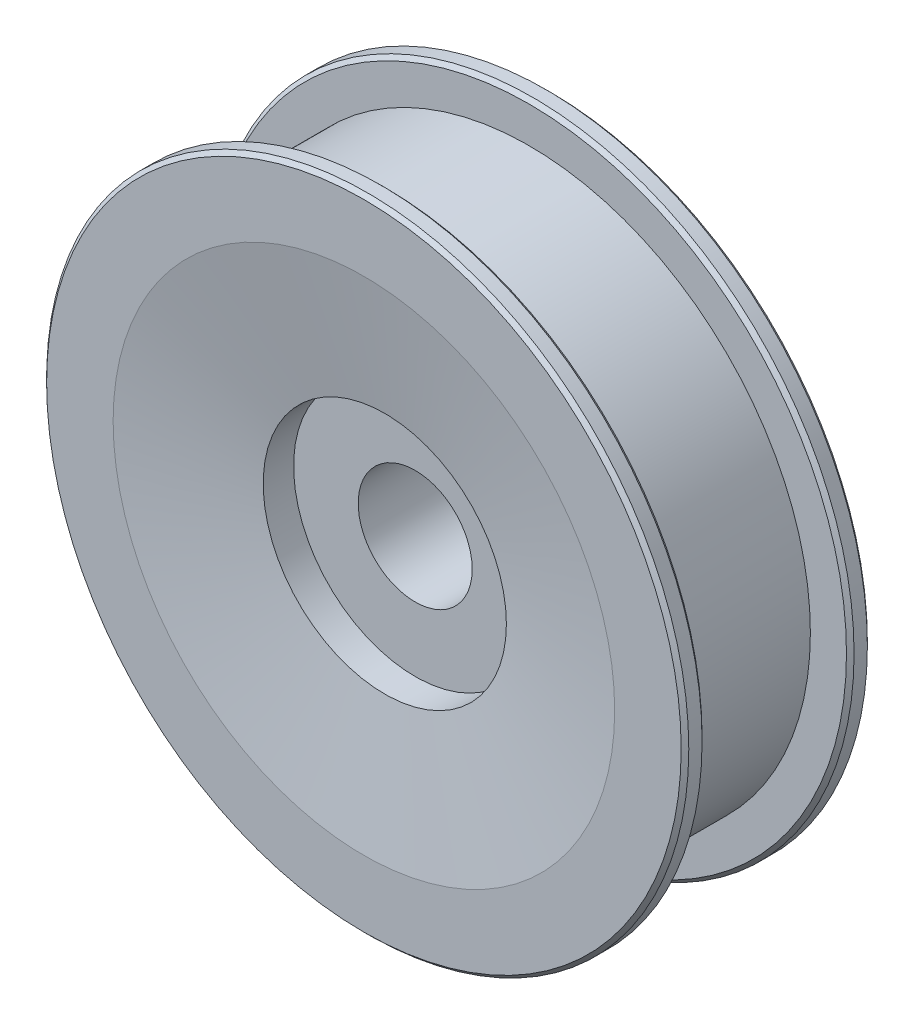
ISO-10303-21;
HEADER;
FILE_DESCRIPTION(('STEP AP214'),'2;1');
FILE_NAME('part.step','',(''),(''),'','','');
FILE_SCHEMA(('AUTOMOTIVE_DESIGN { 1 0 10303 214 1 1 1 1 }'));
ENDSEC;
DATA;
#1=APPLICATION_CONTEXT('core data for automotive mechanical design processes');
#2=APPLICATION_PROTOCOL_DEFINITION('international standard','automotive_design',2000,#1);
#3=PRODUCT_CONTEXT('',#1,'mechanical');
#4=PRODUCT('Part','Part','',(#3));
#5=PRODUCT_RELATED_PRODUCT_CATEGORY('part','',(#4));
#6=PRODUCT_DEFINITION_FORMATION('','',#4);
#7=PRODUCT_DEFINITION_CONTEXT('part definition',#1,'design');
#8=PRODUCT_DEFINITION('design','',#6,#7);
#9=PRODUCT_DEFINITION_SHAPE('','',#8);
#10=(LENGTH_UNIT() NAMED_UNIT(*) SI_UNIT(.MILLI.,.METRE.));
#11=(NAMED_UNIT(*) PLANE_ANGLE_UNIT() SI_UNIT($,.RADIAN.));
#12=(NAMED_UNIT(*) SI_UNIT($,.STERADIAN.) SOLID_ANGLE_UNIT());
#13=UNCERTAINTY_MEASURE_WITH_UNIT(LENGTH_MEASURE(1.E-05),#10,'distance_accuracy_value','');
#14=(GEOMETRIC_REPRESENTATION_CONTEXT(3) GLOBAL_UNCERTAINTY_ASSIGNED_CONTEXT((#13)) GLOBAL_UNIT_ASSIGNED_CONTEXT((#10,
#11,#12)) REPRESENTATION_CONTEXT('',''));
#15=CARTESIAN_POINT('',(0.,0.,0.));
#16=DIRECTION('',(0.,0.,1.));
#17=DIRECTION('',(1.,0.,0.));
#18=AXIS2_PLACEMENT_3D('',#15,#16,#17);
#19=CARTESIAN_POINT('',(0.,-7.5,-5.5));
#20=DIRECTION('',(0.,0.,-1.));
#21=DIRECTION('',(1.,0.,0.));
#22=AXIS2_PLACEMENT_3D('',#19,#20,#21);
#23=PLANE('',#22);
#24=CARTESIAN_POINT('',(0.,0.,-5.5));
#25=DIRECTION('',(0.,0.,-1.));
#26=DIRECTION('',(1.,0.,0.));
#27=AXIS2_PLACEMENT_3D('',#24,#25,#26);
#28=CIRCLE('',#27,16.);
#29=CARTESIAN_POINT('',(16.,0.,-5.5));
#30=VERTEX_POINT('',#29);
#31=EDGE_CURVE('E71',#30,#30,#28,.T.);
#32=ORIENTED_EDGE('',*,*,#31,.T.);
#33=EDGE_LOOP('',(#32));
#34=FACE_BOUND('',#33,.T.);
#35=CARTESIAN_POINT('',(0.,0.,-5.5));
#36=DIRECTION('',(0.,0.,-1.));
#37=DIRECTION('',(1.,0.,0.));
#38=AXIS2_PLACEMENT_3D('',#35,#36,#37);
#39=CIRCLE('',#38,7.5);
#40=CARTESIAN_POINT('',(7.5,0.,-5.5));
#41=VERTEX_POINT('',#40);
#42=EDGE_CURVE('E44',#41,#41,#39,.T.);
#43=ORIENTED_EDGE('',*,*,#42,.F.);
#44=EDGE_LOOP('',(#43));
#45=FACE_BOUND('',#44,.T.);
#46=ADVANCED_FACE('F12',(#34,#45),#23,.T.);
#47=CARTESIAN_POINT('',(0.,0.,-20.));
#48=DIRECTION('',(0.,0.,-1.));
#49=DIRECTION('',(1.,0.,0.));
#50=AXIS2_PLACEMENT_3D('',#47,#48,#49);
#51=CYLINDRICAL_SURFACE('',#50,7.5);
#52=ORIENTED_EDGE('',*,*,#42,.T.);
#53=EDGE_LOOP('',(#52));
#54=FACE_BOUND('',#53,.T.);
#55=CARTESIAN_POINT('',(0.,0.,5.5));
#56=DIRECTION('',(0.,0.,-1.));
#57=DIRECTION('',(1.,0.,0.));
#58=AXIS2_PLACEMENT_3D('',#55,#56,#57);
#59=CIRCLE('',#58,7.5);
#60=CARTESIAN_POINT('',(7.5,0.,5.5));
#61=VERTEX_POINT('',#60);
#62=EDGE_CURVE('E47',#61,#61,#59,.T.);
#63=ORIENTED_EDGE('',*,*,#62,.F.);
#64=EDGE_LOOP('',(#63));
#65=FACE_BOUND('',#64,.T.);
#66=ADVANCED_FACE('F96',(#54,#65),#51,.F.);
#67=CARTESIAN_POINT('',(0.,-7.5,5.5));
#68=DIRECTION('',(0.,0.,-1.));
#69=DIRECTION('',(1.,0.,0.));
#70=AXIS2_PLACEMENT_3D('',#67,#68,#69);
#71=PLANE('',#70);
#72=CARTESIAN_POINT('',(0.,0.,5.5));
#73=DIRECTION('',(0.,0.,-1.));
#74=DIRECTION('',(1.,0.,0.));
#75=AXIS2_PLACEMENT_3D('',#72,#73,#74);
#76=CIRCLE('',#75,16.);
#77=CARTESIAN_POINT('',(16.,0.,5.5));
#78=VERTEX_POINT('',#77);
#79=EDGE_CURVE('E50',#78,#78,#76,.T.);
#80=ORIENTED_EDGE('',*,*,#79,.F.);
#81=EDGE_LOOP('',(#80));
#82=FACE_BOUND('',#81,.T.);
#83=ORIENTED_EDGE('',*,*,#62,.T.);
#84=EDGE_LOOP('',(#83));
#85=FACE_BOUND('',#84,.T.);
#86=ADVANCED_FACE('F102',(#82,#85),#71,.F.);
#87=CARTESIAN_POINT('',(0.,0.,-20.));
#88=DIRECTION('',(0.,0.,-1.));
#89=DIRECTION('',(1.,0.,0.));
#90=AXIS2_PLACEMENT_3D('',#87,#88,#89);
#91=CYLINDRICAL_SURFACE('',#90,16.);
#92=CARTESIAN_POINT('',(0.,0.,9.5));
#93=DIRECTION('',(0.,0.,-1.));
#94=DIRECTION('',(1.,0.,0.));
#95=AXIS2_PLACEMENT_3D('',#92,#93,#94);
#96=CIRCLE('',#95,16.);
#97=CARTESIAN_POINT('',(16.,0.,9.5));
#98=VERTEX_POINT('',#97);
#99=EDGE_CURVE('E53',#98,#98,#96,.T.);
#100=ORIENTED_EDGE('',*,*,#99,.F.);
#101=EDGE_LOOP('',(#100));
#102=FACE_BOUND('',#101,.T.);
#103=ORIENTED_EDGE('',*,*,#79,.T.);
#104=EDGE_LOOP('',(#103));
#105=FACE_BOUND('',#104,.T.);
#106=ADVANCED_FACE('F141',(#102,#105),#91,.F.);
#107=CARTESIAN_POINT('',(0.,0.,9.5));
#108=DIRECTION('',(0.,0.,1.));
#109=DIRECTION('',(-1.,0.,0.));
#110=AXIS2_PLACEMENT_3D('',#107,#108,#109);
#111=CONICAL_SURFACE('',#110,16.,1.41042088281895);
#112=CARTESIAN_POINT('',(0.,0.,12.25));
#113=DIRECTION('',(0.,0.,-1.));
#114=DIRECTION('',(1.,0.,0.));
#115=AXIS2_PLACEMENT_3D('',#112,#113,#114);
#116=CIRCLE('',#115,33.);
#117=CARTESIAN_POINT('',(33.,0.,12.25));
#118=VERTEX_POINT('',#117);
#119=EDGE_CURVE('E56',#118,#118,#116,.T.);
#120=ORIENTED_EDGE('',*,*,#119,.F.);
#121=EDGE_LOOP('',(#120));
#122=FACE_BOUND('',#121,.T.);
#123=ORIENTED_EDGE('',*,*,#99,.T.);
#124=EDGE_LOOP('',(#123));
#125=FACE_BOUND('',#124,.T.);
#126=ADVANCED_FACE('F135',(#122,#125),#111,.F.);
#127=CARTESIAN_POINT('',(0.,-42.25,12.25));
#128=DIRECTION('',(0.,0.,1.));
#129=DIRECTION('',(-1.,0.,0.));
#130=AXIS2_PLACEMENT_3D('',#127,#128,#129);
#131=PLANE('',#130);
#132=CARTESIAN_POINT('',(0.,0.,12.25));
#133=DIRECTION('',(0.,0.,1.));
#134=DIRECTION('',(1.,0.,0.));
#135=AXIS2_PLACEMENT_3D('',#132,#133,#134);
#136=CIRCLE('',#135,41.75);
#137=CARTESIAN_POINT('',(41.75,0.,12.25));
#138=VERTEX_POINT('',#137);
#139=EDGE_CURVE('E19',#138,#138,#136,.T.);
#140=ORIENTED_EDGE('',*,*,#139,.T.);
#141=EDGE_LOOP('',(#140));
#142=FACE_BOUND('',#141,.T.);
#143=ORIENTED_EDGE('',*,*,#119,.T.);
#144=EDGE_LOOP('',(#143));
#145=FACE_BOUND('',#144,.T.);
#146=ADVANCED_FACE('F124',(#142,#145),#131,.T.);
#147=CARTESIAN_POINT('',(0.,0.,-20.));
#148=DIRECTION('',(0.,0.,-1.));
#149=DIRECTION('',(1.,0.,0.));
#150=AXIS2_PLACEMENT_3D('',#147,#148,#149);
#151=CYLINDRICAL_SURFACE('',#150,42.25);
#152=CARTESIAN_POINT('',(0.,0.,11.75));
#153=DIRECTION('',(0.,0.,1.));
#154=DIRECTION('',(1.,0.,0.));
#155=AXIS2_PLACEMENT_3D('',#152,#153,#154);
#156=CIRCLE('',#155,42.25);
#157=CARTESIAN_POINT('',(42.25,0.,11.75));
#158=VERTEX_POINT('',#157);
#159=EDGE_CURVE('E23',#158,#158,#156,.F.);
#160=ORIENTED_EDGE('',*,*,#159,.T.);
#161=EDGE_LOOP('',(#160));
#162=FACE_BOUND('',#161,.T.);
#163=CARTESIAN_POINT('',(0.,0.,10.));
#164=DIRECTION('',(0.,0.,1.));
#165=DIRECTION('',(1.,0.,0.));
#166=AXIS2_PLACEMENT_3D('',#163,#164,#165);
#167=CIRCLE('',#166,42.25);
#168=CARTESIAN_POINT('',(42.25,0.,10.));
#169=VERTEX_POINT('',#168);
#170=EDGE_CURVE('E27',#169,#169,#167,.T.);
#171=ORIENTED_EDGE('',*,*,#170,.T.);
#172=EDGE_LOOP('',(#171));
#173=FACE_BOUND('',#172,.T.);
#174=ADVANCED_FACE('F120',(#162,#173),#151,.T.);
#175=CARTESIAN_POINT('',(0.,-42.25,9.5));
#176=DIRECTION('',(0.,0.,1.));
#177=DIRECTION('',(-1.,0.,0.));
#178=AXIS2_PLACEMENT_3D('',#175,#176,#177);
#179=PLANE('',#178);
#180=CARTESIAN_POINT('',(0.,0.,9.5));
#181=DIRECTION('',(0.,0.,1.));
#182=DIRECTION('',(1.,0.,0.));
#183=AXIS2_PLACEMENT_3D('',#180,#181,#182);
#184=CIRCLE('',#183,41.75);
#185=CARTESIAN_POINT('',(41.75,0.,9.5));
#186=VERTEX_POINT('',#185);
#187=EDGE_CURVE('E8',#186,#186,#184,.F.);
#188=ORIENTED_EDGE('',*,*,#187,.T.);
#189=EDGE_LOOP('',(#188));
#190=FACE_BOUND('',#189,.T.);
#191=CARTESIAN_POINT('',(0.,0.,9.5));
#192=DIRECTION('',(0.,0.,-1.));
#193=DIRECTION('',(1.,0.,0.));
#194=AXIS2_PLACEMENT_3D('',#191,#192,#193);
#195=CIRCLE('',#194,37.);
#196=CARTESIAN_POINT('',(37.,0.,9.5));
#197=VERTEX_POINT('',#196);
#198=EDGE_CURVE('E59',#197,#197,#195,.T.);
#199=ORIENTED_EDGE('',*,*,#198,.F.);
#200=EDGE_LOOP('',(#199));
#201=FACE_BOUND('',#200,.T.);
#202=ADVANCED_FACE('F123',(#190,#201),#179,.F.);
#203=CARTESIAN_POINT('',(0.,0.,-20.));
#204=DIRECTION('',(0.,0.,-1.));
#205=DIRECTION('',(1.,0.,0.));
#206=AXIS2_PLACEMENT_3D('',#203,#204,#205);
#207=CYLINDRICAL_SURFACE('',#206,37.);
#208=ORIENTED_EDGE('',*,*,#198,.T.);
#209=EDGE_LOOP('',(#208));
#210=FACE_BOUND('',#209,.T.);
#211=CARTESIAN_POINT('',(0.,0.,-9.5));
#212=DIRECTION('',(0.,0.,-1.));
#213=DIRECTION('',(1.,0.,0.));
#214=AXIS2_PLACEMENT_3D('',#211,#212,#213);
#215=CIRCLE('',#214,37.);
#216=CARTESIAN_POINT('',(37.,0.,-9.5));
#217=VERTEX_POINT('',#216);
#218=EDGE_CURVE('E62',#217,#217,#215,.T.);
#219=ORIENTED_EDGE('',*,*,#218,.F.);
#220=EDGE_LOOP('',(#219));
#221=FACE_BOUND('',#220,.T.);
#222=ADVANCED_FACE('F133',(#210,#221),#207,.T.);
#223=CARTESIAN_POINT('',(0.,-42.25,-9.5));
#224=DIRECTION('',(0.,0.,1.));
#225=DIRECTION('',(-1.,0.,0.));
#226=AXIS2_PLACEMENT_3D('',#223,#224,#225);
#227=PLANE('',#226);
#228=CARTESIAN_POINT('',(0.,0.,-9.5));
#229=DIRECTION('',(0.,0.,1.));
#230=DIRECTION('',(1.,0.,0.));
#231=AXIS2_PLACEMENT_3D('',#228,#229,#230);
#232=CIRCLE('',#231,41.75);
#233=CARTESIAN_POINT('',(41.75,0.,-9.5));
#234=VERTEX_POINT('',#233);
#235=EDGE_CURVE('E32',#234,#234,#232,.T.);
#236=ORIENTED_EDGE('',*,*,#235,.T.);
#237=EDGE_LOOP('',(#236));
#238=FACE_BOUND('',#237,.T.);
#239=ORIENTED_EDGE('',*,*,#218,.T.);
#240=EDGE_LOOP('',(#239));
#241=FACE_BOUND('',#240,.T.);
#242=ADVANCED_FACE('F245',(#238,#241),#227,.T.);
#243=CARTESIAN_POINT('',(0.,0.,-20.));
#244=DIRECTION('',(0.,0.,-1.));
#245=DIRECTION('',(1.,0.,0.));
#246=AXIS2_PLACEMENT_3D('',#243,#244,#245);
#247=CYLINDRICAL_SURFACE('',#246,42.25);
#248=CARTESIAN_POINT('',(0.,0.,-11.75));
#249=DIRECTION('',(0.,0.,1.));
#250=DIRECTION('',(1.,0.,0.));
#251=AXIS2_PLACEMENT_3D('',#248,#249,#250);
#252=CIRCLE('',#251,42.25);
#253=CARTESIAN_POINT('',(42.25,0.,-11.75));
#254=VERTEX_POINT('',#253);
#255=EDGE_CURVE('E35',#254,#254,#252,.T.);
#256=ORIENTED_EDGE('',*,*,#255,.T.);
#257=EDGE_LOOP('',(#256));
#258=FACE_BOUND('',#257,.T.);
#259=CARTESIAN_POINT('',(0.,0.,-10.));
#260=DIRECTION('',(0.,0.,1.));
#261=DIRECTION('',(1.,0.,0.));
#262=AXIS2_PLACEMENT_3D('',#259,#260,#261);
#263=CIRCLE('',#262,42.25);
#264=CARTESIAN_POINT('',(42.25,0.,-10.));
#265=VERTEX_POINT('',#264);
#266=EDGE_CURVE('E38',#265,#265,#263,.F.);
#267=ORIENTED_EDGE('',*,*,#266,.T.);
#268=EDGE_LOOP('',(#267));
#269=FACE_BOUND('',#268,.T.);
#270=ADVANCED_FACE('F237',(#258,#269),#247,.T.);
#271=CARTESIAN_POINT('',(0.,-42.25,-12.25));
#272=DIRECTION('',(0.,0.,1.));
#273=DIRECTION('',(-1.,0.,0.));
#274=AXIS2_PLACEMENT_3D('',#271,#272,#273);
#275=PLANE('',#274);
#276=CARTESIAN_POINT('',(0.,0.,-12.25));
#277=DIRECTION('',(0.,0.,1.));
#278=DIRECTION('',(1.,0.,0.));
#279=AXIS2_PLACEMENT_3D('',#276,#277,#278);
#280=CIRCLE('',#279,41.75);
#281=CARTESIAN_POINT('',(41.75,0.,-12.25));
#282=VERTEX_POINT('',#281);
#283=EDGE_CURVE('E41',#282,#282,#280,.F.);
#284=ORIENTED_EDGE('',*,*,#283,.T.);
#285=EDGE_LOOP('',(#284));
#286=FACE_BOUND('',#285,.T.);
#287=CARTESIAN_POINT('',(0.,0.,-12.25));
#288=DIRECTION('',(0.,0.,-1.));
#289=DIRECTION('',(1.,0.,0.));
#290=AXIS2_PLACEMENT_3D('',#287,#288,#289);
#291=CIRCLE('',#290,33.);
#292=CARTESIAN_POINT('',(33.,0.,-12.25));
#293=VERTEX_POINT('',#292);
#294=EDGE_CURVE('E65',#293,#293,#291,.T.);
#295=ORIENTED_EDGE('',*,*,#294,.F.);
#296=EDGE_LOOP('',(#295));
#297=FACE_BOUND('',#296,.T.);
#298=ADVANCED_FACE('F92',(#286,#297),#275,.F.);
#299=CARTESIAN_POINT('',(0.,0.,-9.5));
#300=DIRECTION('',(0.,0.,-1.));
#301=DIRECTION('',(1.,0.,0.));
#302=AXIS2_PLACEMENT_3D('',#299,#300,#301);
#303=CONICAL_SURFACE('',#302,16.,1.41042088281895);
#304=ORIENTED_EDGE('',*,*,#294,.T.);
#305=EDGE_LOOP('',(#304));
#306=FACE_BOUND('',#305,.T.);
#307=CARTESIAN_POINT('',(0.,0.,-9.5));
#308=DIRECTION('',(0.,0.,-1.));
#309=DIRECTION('',(1.,0.,0.));
#310=AXIS2_PLACEMENT_3D('',#307,#308,#309);
#311=CIRCLE('',#310,16.);
#312=CARTESIAN_POINT('',(16.,0.,-9.5));
#313=VERTEX_POINT('',#312);
#314=EDGE_CURVE('E68',#313,#313,#311,.T.);
#315=ORIENTED_EDGE('',*,*,#314,.F.);
#316=EDGE_LOOP('',(#315));
#317=FACE_BOUND('',#316,.T.);
#318=ADVANCED_FACE('F80',(#306,#317),#303,.F.);
#319=CARTESIAN_POINT('',(0.,0.,-20.));
#320=DIRECTION('',(0.,0.,-1.));
#321=DIRECTION('',(1.,0.,0.));
#322=AXIS2_PLACEMENT_3D('',#319,#320,#321);
#323=CYLINDRICAL_SURFACE('',#322,16.);
#324=ORIENTED_EDGE('',*,*,#314,.T.);
#325=EDGE_LOOP('',(#324));
#326=FACE_BOUND('',#325,.T.);
#327=ORIENTED_EDGE('',*,*,#31,.F.);
#328=EDGE_LOOP('',(#327));
#329=FACE_BOUND('',#328,.T.);
#330=ADVANCED_FACE('F77',(#326,#329),#323,.F.);
#331=CARTESIAN_POINT('',(0.,0.,-12.25));
#332=DIRECTION('',(0.,0.,1.));
#333=DIRECTION('',(1.,0.,0.));
#334=AXIS2_PLACEMENT_3D('',#331,#332,#333);
#335=CONICAL_SURFACE('',#334,41.75,0.785398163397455);
#336=ORIENTED_EDGE('',*,*,#255,.F.);
#337=EDGE_LOOP('',(#336));
#338=FACE_BOUND('',#337,.T.);
#339=ORIENTED_EDGE('',*,*,#283,.F.);
#340=EDGE_LOOP('',(#339));
#341=FACE_BOUND('',#340,.T.);
#342=ADVANCED_FACE('F79',(#338,#341),#335,.T.);
#343=CARTESIAN_POINT('',(0.,0.,-10.));
#344=DIRECTION('',(0.,0.,-1.));
#345=DIRECTION('',(-1.,0.,0.));
#346=AXIS2_PLACEMENT_3D('',#343,#344,#345);
#347=CONICAL_SURFACE('',#346,42.25,0.785398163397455);
#348=ORIENTED_EDGE('',*,*,#235,.F.);
#349=EDGE_LOOP('',(#348));
#350=FACE_BOUND('',#349,.T.);
#351=ORIENTED_EDGE('',*,*,#266,.F.);
#352=EDGE_LOOP('',(#351));
#353=FACE_BOUND('',#352,.T.);
#354=ADVANCED_FACE('F89',(#350,#353),#347,.T.);
#355=CARTESIAN_POINT('',(0.,0.,11.75));
#356=DIRECTION('',(0.,0.,-1.));
#357=DIRECTION('',(-1.,0.,0.));
#358=AXIS2_PLACEMENT_3D('',#355,#356,#357);
#359=CONICAL_SURFACE('',#358,42.25,0.785398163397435);
#360=ORIENTED_EDGE('',*,*,#139,.F.);
#361=EDGE_LOOP('',(#360));
#362=FACE_BOUND('',#361,.T.);
#363=ORIENTED_EDGE('',*,*,#159,.F.);
#364=EDGE_LOOP('',(#363));
#365=FACE_BOUND('',#364,.T.);
#366=ADVANCED_FACE('F108',(#362,#365),#359,.T.);
#367=CARTESIAN_POINT('',(0.,0.,9.5));
#368=DIRECTION('',(0.,0.,1.));
#369=DIRECTION('',(1.,0.,0.));
#370=AXIS2_PLACEMENT_3D('',#367,#368,#369);
#371=CONICAL_SURFACE('',#370,41.75,0.785398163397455);
#372=ORIENTED_EDGE('',*,*,#170,.F.);
#373=EDGE_LOOP('',(#372));
#374=FACE_BOUND('',#373,.T.);
#375=ORIENTED_EDGE('',*,*,#187,.F.);
#376=EDGE_LOOP('',(#375));
#377=FACE_BOUND('',#376,.T.);
#378=ADVANCED_FACE('F14',(#374,#377),#371,.T.);
#379=CLOSED_SHELL('',(#46,#66,#86,#106,#126,#146,#174,#202,#222,#242,#270,#298,#318,#330,#342,
#354,#366,#378));
#380=MANIFOLD_SOLID_BREP('B1',#379);
#381=ADVANCED_BREP_SHAPE_REPRESENTATION('',(#18,#380),#14);
#382=SHAPE_DEFINITION_REPRESENTATION(#9,#381);
ENDSEC;
END-ISO-10303-21;
